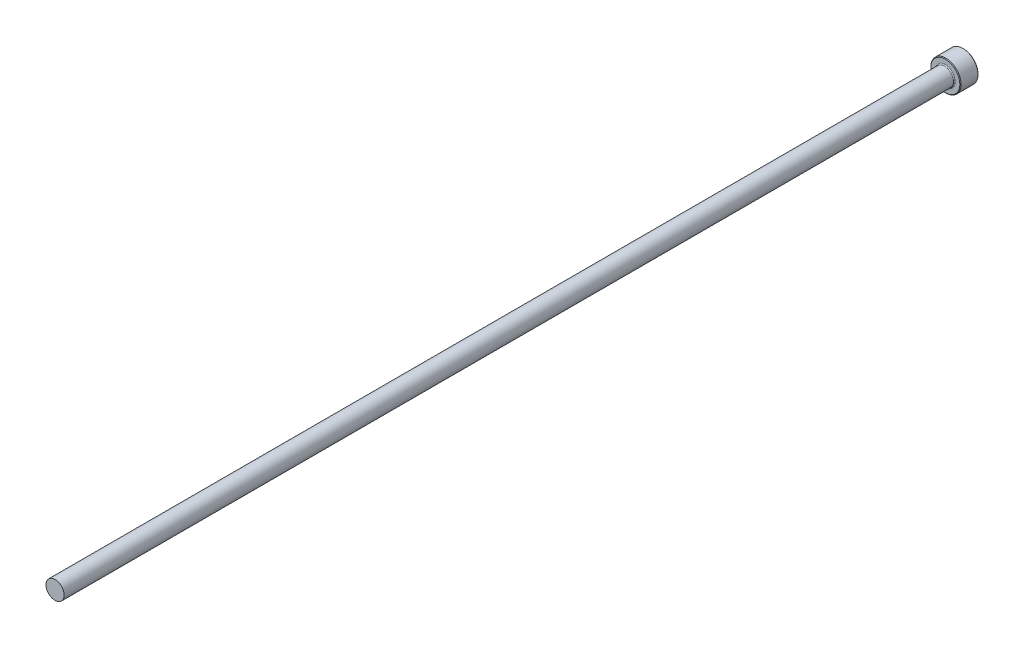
ISO-10303-21;
HEADER;
FILE_DESCRIPTION(('STEP AP214'),'2;1');
FILE_NAME('part.step','',(''),(''),'','','');
FILE_SCHEMA(('AUTOMOTIVE_DESIGN { 1 0 10303 214 1 1 1 1 }'));
ENDSEC;
DATA;
#1=APPLICATION_CONTEXT('core data for automotive mechanical design processes');
#2=APPLICATION_PROTOCOL_DEFINITION('international standard','automotive_design',2000,#1);
#3=PRODUCT_CONTEXT('',#1,'mechanical');
#4=PRODUCT('Part','Part','',(#3));
#5=PRODUCT_RELATED_PRODUCT_CATEGORY('part','',(#4));
#6=PRODUCT_DEFINITION_FORMATION('','',#4);
#7=PRODUCT_DEFINITION_CONTEXT('part definition',#1,'design');
#8=PRODUCT_DEFINITION('design','',#6,#7);
#9=PRODUCT_DEFINITION_SHAPE('','',#8);
#10=(LENGTH_UNIT() NAMED_UNIT(*) SI_UNIT(.MILLI.,.METRE.));
#11=(NAMED_UNIT(*) PLANE_ANGLE_UNIT() SI_UNIT($,.RADIAN.));
#12=(NAMED_UNIT(*) SI_UNIT($,.STERADIAN.) SOLID_ANGLE_UNIT());
#13=UNCERTAINTY_MEASURE_WITH_UNIT(LENGTH_MEASURE(1.E-05),#10,'distance_accuracy_value','');
#14=(GEOMETRIC_REPRESENTATION_CONTEXT(3) GLOBAL_UNCERTAINTY_ASSIGNED_CONTEXT((#13)) GLOBAL_UNIT_ASSIGNED_CONTEXT((#10,
#11,#12)) REPRESENTATION_CONTEXT('',''));
#15=CARTESIAN_POINT('',(0.,0.,0.));
#16=DIRECTION('',(0.,0.,1.));
#17=DIRECTION('',(1.,0.,0.));
#18=AXIS2_PLACEMENT_3D('',#15,#16,#17);
#19=CARTESIAN_POINT('',(0.,2.99999999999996,300.));
#20=DIRECTION('',(0.,0.,-1.));
#21=DIRECTION('',(-1.,0.,0.));
#22=AXIS2_PLACEMENT_3D('',#19,#20,#21);
#23=PLANE('',#22);
#24=CARTESIAN_POINT('',(0.,0.,300.));
#25=DIRECTION('',(0.,0.,1.));
#26=DIRECTION('',(1.,0.,0.));
#27=AXIS2_PLACEMENT_3D('',#24,#25,#26);
#28=CIRCLE('',#27,2.99999999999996);
#29=CARTESIAN_POINT('',(2.99999999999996,0.,300.));
#30=VERTEX_POINT('',#29);
#31=EDGE_CURVE('E50',#30,#30,#28,.T.);
#32=ORIENTED_EDGE('',*,*,#31,.T.);
#33=EDGE_LOOP('',(#32));
#34=FACE_BOUND('',#33,.T.);
#35=ADVANCED_FACE('F30',(#34),#23,.F.);
#36=CARTESIAN_POINT('',(0.,0.,109.050628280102));
#37=DIRECTION('',(0.,0.,1.));
#38=DIRECTION('',(1.,0.,0.));
#39=AXIS2_PLACEMENT_3D('',#36,#37,#38);
#40=CYLINDRICAL_SURFACE('',#39,2.99999999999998);
#41=ORIENTED_EDGE('',*,*,#31,.F.);
#42=EDGE_LOOP('',(#41));
#43=FACE_BOUND('',#42,.T.);
#44=CARTESIAN_POINT('',(0.,0.,6.3));
#45=DIRECTION('',(0.,0.,1.));
#46=DIRECTION('',(1.,0.,0.));
#47=AXIS2_PLACEMENT_3D('',#44,#45,#46);
#48=CIRCLE('',#47,3.);
#49=CARTESIAN_POINT('',(3.,0.,6.3));
#50=VERTEX_POINT('',#49);
#51=EDGE_CURVE('E53',#50,#50,#48,.T.);
#52=ORIENTED_EDGE('',*,*,#51,.T.);
#53=EDGE_LOOP('',(#52));
#54=FACE_BOUND('',#53,.T.);
#55=ADVANCED_FACE('F73',(#43,#54),#40,.T.);
#56=CARTESIAN_POINT('',(0.,0.,6.3));
#57=DIRECTION('',(0.,0.,1.));
#58=DIRECTION('',(1.,0.,0.));
#59=AXIS2_PLACEMENT_3D('',#56,#57,#58);
#60=TOROIDAL_SURFACE('',#59,3.3,0.3);
#61=ORIENTED_EDGE('',*,*,#51,.F.);
#62=EDGE_LOOP('',(#61));
#63=FACE_BOUND('',#62,.T.);
#64=CARTESIAN_POINT('',(0.,0.,6.00000000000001));
#65=DIRECTION('',(0.,0.,1.));
#66=DIRECTION('',(1.,0.,0.));
#67=AXIS2_PLACEMENT_3D('',#64,#65,#66);
#68=CIRCLE('',#67,3.3);
#69=CARTESIAN_POINT('',(3.3,0.,6.00000000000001));
#70=VERTEX_POINT('',#69);
#71=EDGE_CURVE('E56',#70,#70,#68,.T.);
#72=ORIENTED_EDGE('',*,*,#71,.T.);
#73=EDGE_LOOP('',(#72));
#74=FACE_BOUND('',#73,.T.);
#75=ADVANCED_FACE('F60',(#63,#74),#60,.F.);
#76=CARTESIAN_POINT('',(0.,5.,6.));
#77=DIRECTION('',(0.,0.,-1.));
#78=DIRECTION('',(-1.,0.,0.));
#79=AXIS2_PLACEMENT_3D('',#76,#77,#78);
#80=PLANE('',#79);
#81=CARTESIAN_POINT('',(0.,0.,6.));
#82=DIRECTION('',(0.,0.,-1.));
#83=DIRECTION('',(-1.,0.,0.));
#84=AXIS2_PLACEMENT_3D('',#81,#82,#83);
#85=CIRCLE('',#84,4.8);
#86=CARTESIAN_POINT('',(-4.8,0.,6.));
#87=VERTEX_POINT('',#86);
#88=EDGE_CURVE('E10',#87,#87,#85,.F.);
#89=ORIENTED_EDGE('',*,*,#88,.T.);
#90=EDGE_LOOP('',(#89));
#91=FACE_BOUND('',#90,.T.);
#92=ORIENTED_EDGE('',*,*,#71,.F.);
#93=EDGE_LOOP('',(#92));
#94=FACE_BOUND('',#93,.T.);
#95=ADVANCED_FACE('F62',(#91,#94),#80,.F.);
#96=CARTESIAN_POINT('',(0.,0.,109.050628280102));
#97=DIRECTION('',(0.,0.,1.));
#98=DIRECTION('',(1.,0.,0.));
#99=AXIS2_PLACEMENT_3D('',#96,#97,#98);
#100=CYLINDRICAL_SURFACE('',#99,5.);
#101=CARTESIAN_POINT('',(0.,0.,0.200000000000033));
#102=DIRECTION('',(0.,0.,1.));
#103=DIRECTION('',(1.,0.,0.));
#104=AXIS2_PLACEMENT_3D('',#101,#102,#103);
#105=CIRCLE('',#104,5.);
#106=CARTESIAN_POINT('',(5.,0.,0.200000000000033));
#107=VERTEX_POINT('',#106);
#108=EDGE_CURVE('E41',#107,#107,#105,.T.);
#109=ORIENTED_EDGE('',*,*,#108,.T.);
#110=EDGE_LOOP('',(#109));
#111=FACE_BOUND('',#110,.T.);
#112=CARTESIAN_POINT('',(0.,0.,5.8));
#113=DIRECTION('',(0.,0.,-1.));
#114=DIRECTION('',(-1.,0.,0.));
#115=AXIS2_PLACEMENT_3D('',#112,#113,#114);
#116=CIRCLE('',#115,5.);
#117=CARTESIAN_POINT('',(-5.,0.,5.8));
#118=VERTEX_POINT('',#117);
#119=EDGE_CURVE('E45',#118,#118,#116,.T.);
#120=ORIENTED_EDGE('',*,*,#119,.T.);
#121=EDGE_LOOP('',(#120));
#122=FACE_BOUND('',#121,.T.);
#123=ADVANCED_FACE('F64',(#111,#122),#100,.T.);
#124=CARTESIAN_POINT('',(0.,0.,0.));
#125=DIRECTION('',(0.,0.,1.));
#126=DIRECTION('',(1.,0.,0.));
#127=AXIS2_PLACEMENT_3D('',#124,#125,#126);
#128=PLANE('',#127);
#129=CARTESIAN_POINT('',(0.,0.,0.));
#130=DIRECTION('',(0.,0.,1.));
#131=DIRECTION('',(1.,0.,0.));
#132=AXIS2_PLACEMENT_3D('',#129,#130,#131);
#133=CIRCLE('',#132,4.8);
#134=CARTESIAN_POINT('',(4.8,0.,0.));
#135=VERTEX_POINT('',#134);
#136=EDGE_CURVE('E37',#135,#135,#133,.F.);
#137=ORIENTED_EDGE('',*,*,#136,.T.);
#138=EDGE_LOOP('',(#137));
#139=FACE_BOUND('',#138,.T.);
#140=ADVANCED_FACE('F70',(#139),#128,.F.);
#141=CARTESIAN_POINT('',(0.,0.,0.200000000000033));
#142=DIRECTION('',(0.,0.,1.));
#143=DIRECTION('',(1.,0.,0.));
#144=AXIS2_PLACEMENT_3D('',#141,#142,#143);
#145=CONICAL_SURFACE('',#144,5.,0.785398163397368);
#146=ORIENTED_EDGE('',*,*,#136,.F.);
#147=EDGE_LOOP('',(#146));
#148=FACE_BOUND('',#147,.T.);
#149=ORIENTED_EDGE('',*,*,#108,.F.);
#150=EDGE_LOOP('',(#149));
#151=FACE_BOUND('',#150,.T.);
#152=ADVANCED_FACE('F84',(#148,#151),#145,.T.);
#153=CARTESIAN_POINT('',(0.,0.,6.00000000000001));
#154=DIRECTION('',(0.,0.,-1.));
#155=DIRECTION('',(-1.,0.,0.));
#156=AXIS2_PLACEMENT_3D('',#153,#154,#155);
#157=CONICAL_SURFACE('',#156,4.8,0.785398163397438);
#158=ORIENTED_EDGE('',*,*,#119,.F.);
#159=EDGE_LOOP('',(#158));
#160=FACE_BOUND('',#159,.T.);
#161=ORIENTED_EDGE('',*,*,#88,.F.);
#162=EDGE_LOOP('',(#161));
#163=FACE_BOUND('',#162,.T.);
#164=ADVANCED_FACE('F32',(#160,#163),#157,.T.);
#165=CLOSED_SHELL('',(#35,#55,#75,#95,#123,#140,#152,#164));
#166=MANIFOLD_SOLID_BREP('B2',#165);
#167=ADVANCED_BREP_SHAPE_REPRESENTATION('',(#18,#166),#14);
#168=SHAPE_DEFINITION_REPRESENTATION(#9,#167);
ENDSEC;
END-ISO-10303-21;
